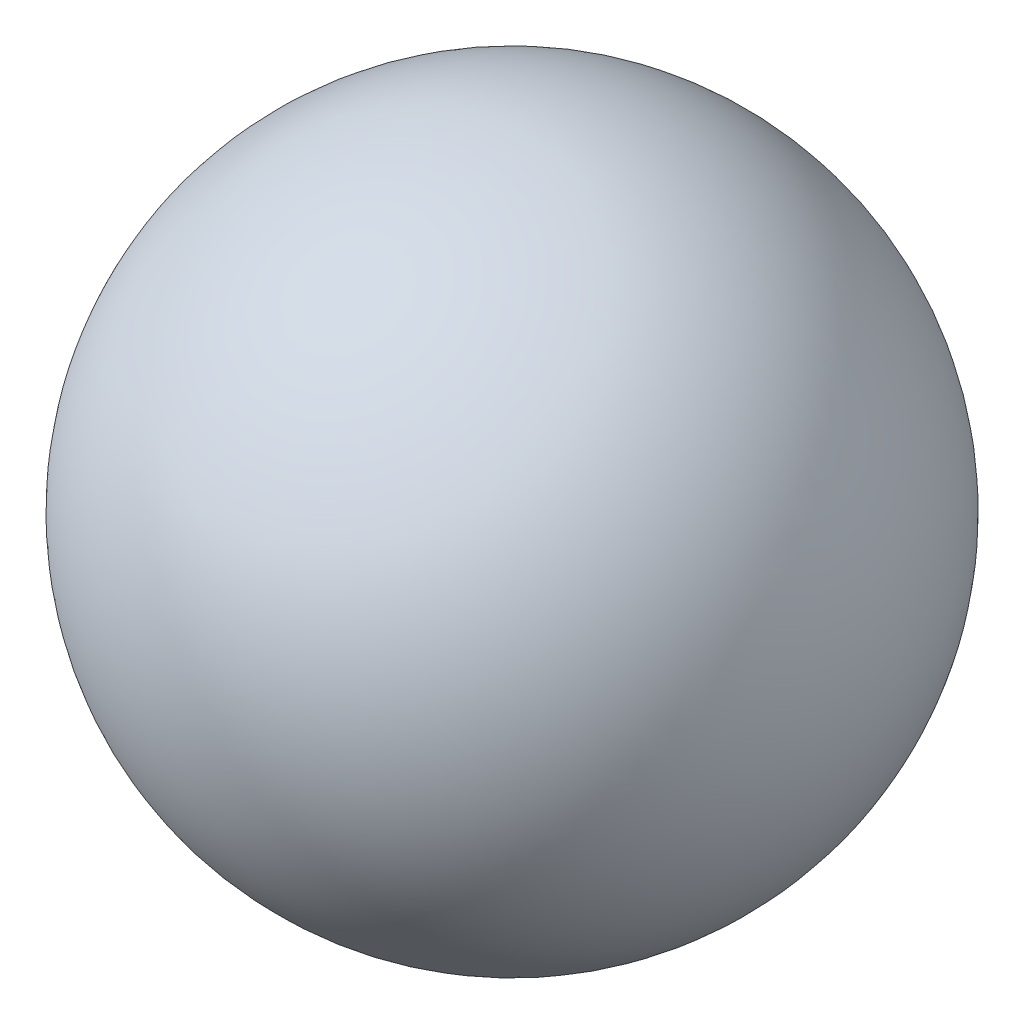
from build123d import *


with BuildPart() as part:
    # Croquis1 → Revoluci_n1 (revolve)
    with BuildSketch(Plane.XY):
        with BuildLine():
            Line((16.247, 25.5), (2.753, 25.5))
            ThreePointArc((2.753, 25.5), (9.5, 32.247), (16.247, 25.5))
        make_face()
    revolve(axis=Axis((16.247, 25.5, 0), (-1, 0, 0)))


solid = part.part
